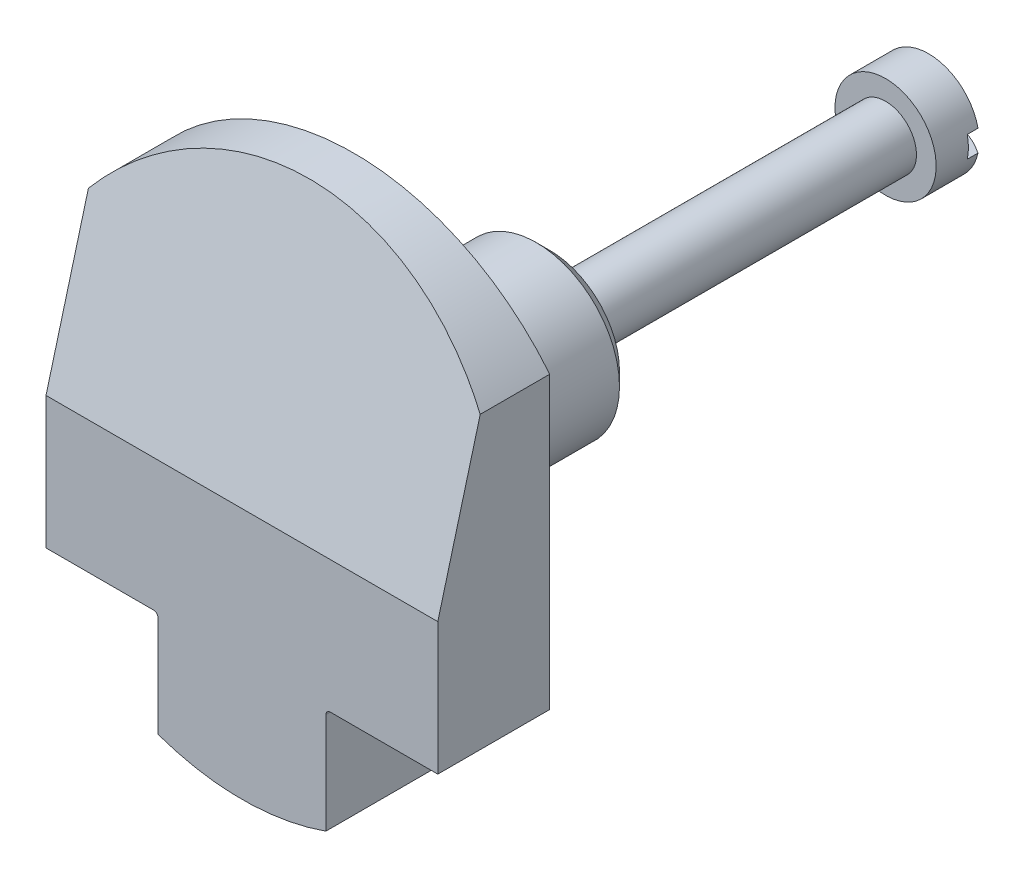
ISO-10303-21;
HEADER;
FILE_DESCRIPTION(('STEP AP214'),'2;1');
FILE_NAME('part.step','',(''),(''),'','','');
FILE_SCHEMA(('AUTOMOTIVE_DESIGN { 1 0 10303 214 1 1 1 1 }'));
ENDSEC;
DATA;
#1=APPLICATION_CONTEXT('core data for automotive mechanical design processes');
#2=APPLICATION_PROTOCOL_DEFINITION('international standard','automotive_design',2000,#1);
#3=PRODUCT_CONTEXT('',#1,'mechanical');
#4=PRODUCT('Part','Part','',(#3));
#5=PRODUCT_RELATED_PRODUCT_CATEGORY('part','',(#4));
#6=PRODUCT_DEFINITION_FORMATION('','',#4);
#7=PRODUCT_DEFINITION_CONTEXT('part definition',#1,'design');
#8=PRODUCT_DEFINITION('design','',#6,#7);
#9=PRODUCT_DEFINITION_SHAPE('','',#8);
#10=(LENGTH_UNIT() NAMED_UNIT(*) SI_UNIT(.MILLI.,.METRE.));
#11=(NAMED_UNIT(*) PLANE_ANGLE_UNIT() SI_UNIT($,.RADIAN.));
#12=(NAMED_UNIT(*) SI_UNIT($,.STERADIAN.) SOLID_ANGLE_UNIT());
#13=UNCERTAINTY_MEASURE_WITH_UNIT(LENGTH_MEASURE(1.E-05),#10,'distance_accuracy_value','');
#14=(GEOMETRIC_REPRESENTATION_CONTEXT(3) GLOBAL_UNCERTAINTY_ASSIGNED_CONTEXT((#13)) GLOBAL_UNIT_ASSIGNED_CONTEXT((#10,
#11,#12)) REPRESENTATION_CONTEXT('',''));
#15=CARTESIAN_POINT('',(0.,0.,0.));
#16=DIRECTION('',(0.,0.,1.));
#17=DIRECTION('',(1.,0.,0.));
#18=AXIS2_PLACEMENT_3D('',#15,#16,#17);
#19=CARTESIAN_POINT('',(0.,0.,-11.1125));
#20=DIRECTION('',(0.,0.,-1.));
#21=DIRECTION('',(-1.,0.,0.));
#22=AXIS2_PLACEMENT_3D('',#19,#20,#21);
#23=PLANE('',#22);
#24=CARTESIAN_POINT('',(0.,0.,-11.1125000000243));
#25=DIRECTION('',(0.,0.,1.));
#26=DIRECTION('',(1.,0.,0.));
#27=AXIS2_PLACEMENT_3D('',#24,#25,#26);
#28=CIRCLE('',#27,3.95604999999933);
#29=CARTESIAN_POINT('',(3.95604999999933,0.,-11.1125000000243));
#30=VERTEX_POINT('',#29);
#31=EDGE_CURVE('E263',#30,#30,#28,.T.);
#32=ORIENTED_EDGE('',*,*,#31,.F.);
#33=EDGE_LOOP('',(#32));
#34=FACE_BOUND('',#33,.T.);
#35=CARTESIAN_POINT('',(0.,0.,-11.1125));
#36=DIRECTION('',(0.,0.,-1.));
#37=DIRECTION('',(-1.,0.,0.));
#38=AXIS2_PLACEMENT_3D('',#35,#36,#37);
#39=CIRCLE('',#38,1.7526);
#40=CARTESIAN_POINT('',(-1.7526,0.,-11.1125));
#41=VERTEX_POINT('',#40);
#42=EDGE_CURVE('E9',#41,#41,#39,.F.);
#43=ORIENTED_EDGE('',*,*,#42,.T.);
#44=EDGE_LOOP('',(#43));
#45=FACE_BOUND('',#44,.T.);
#46=ADVANCED_FACE('F14',(#34,#45),#23,.T.);
#47=CARTESIAN_POINT('',(0.,0.,-10.3504999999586));
#48=DIRECTION('',(0.,0.,1.));
#49=DIRECTION('',(1.,0.,0.));
#50=AXIS2_PLACEMENT_3D('',#47,#48,#49);
#51=CONICAL_SURFACE('',#50,4.71805000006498,0.785398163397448);
#52=CARTESIAN_POINT('',(0.,0.,-10.3505));
#53=DIRECTION('',(0.,0.,1.));
#54=DIRECTION('',(1.,0.,0.));
#55=AXIS2_PLACEMENT_3D('',#52,#53,#54);
#56=CIRCLE('',#55,4.71805);
#57=CARTESIAN_POINT('',(4.71805,0.,-10.3505));
#58=VERTEX_POINT('',#57);
#59=EDGE_CURVE('E125',#58,#58,#56,.T.);
#60=ORIENTED_EDGE('',*,*,#59,.F.);
#61=EDGE_LOOP('',(#60));
#62=FACE_BOUND('',#61,.T.);
#63=ORIENTED_EDGE('',*,*,#31,.T.);
#64=EDGE_LOOP('',(#63));
#65=FACE_BOUND('',#64,.T.);
#66=ADVANCED_FACE('F286',(#62,#65),#51,.T.);
#67=CARTESIAN_POINT('',(0.,0.,-11.1125));
#68=DIRECTION('',(0.,0.,1.));
#69=DIRECTION('',(1.,0.,0.));
#70=AXIS2_PLACEMENT_3D('',#67,#68,#69);
#71=CYLINDRICAL_SURFACE('',#70,4.71805);
#72=CARTESIAN_POINT('',(0.,0.,-0.254));
#73=DIRECTION('',(0.,0.,1.));
#74=DIRECTION('',(1.,0.,0.));
#75=AXIS2_PLACEMENT_3D('',#72,#73,#74);
#76=CIRCLE('',#75,4.71805);
#77=CARTESIAN_POINT('',(4.71805,0.,-0.254));
#78=VERTEX_POINT('',#77);
#79=EDGE_CURVE('E258',#78,#78,#76,.F.);
#80=ORIENTED_EDGE('',*,*,#79,.T.);
#81=EDGE_LOOP('',(#80));
#82=FACE_BOUND('',#81,.T.);
#83=ORIENTED_EDGE('',*,*,#59,.T.);
#84=EDGE_LOOP('',(#83));
#85=FACE_BOUND('',#84,.T.);
#86=ADVANCED_FACE('F284',(#82,#85),#71,.T.);
#87=CARTESIAN_POINT('',(5.0165,-7.747,6.35));
#88=DIRECTION('',(0.,0.,1.));
#89=DIRECTION('',(1.,0.,0.));
#90=AXIS2_PLACEMENT_3D('',#87,#88,#89);
#91=CYLINDRICAL_SURFACE('',#90,0.254);
#92=DIRECTION('',(0.,0.,1.));
#93=VECTOR('',#92,1.);
#94=CARTESIAN_POINT('',(4.7625,-7.747,6.35));
#95=LINE('',#94,#93);
#96=CARTESIAN_POINT('',(4.7625,-7.747,6.35));
#97=VERTEX_POINT('',#96);
#98=CARTESIAN_POINT('',(4.7625,-7.747,0.));
#99=VERTEX_POINT('',#98);
#100=EDGE_CURVE('E128',#97,#99,#95,.F.);
#101=ORIENTED_EDGE('',*,*,#100,.T.);
#102=CARTESIAN_POINT('',(5.0165,-7.747,0.));
#103=DIRECTION('',(0.,0.,1.));
#104=DIRECTION('',(1.,0.,0.));
#105=AXIS2_PLACEMENT_3D('',#102,#103,#104);
#106=CIRCLE('',#105,0.254);
#107=CARTESIAN_POINT('',(5.0165,-7.493,0.));
#108=VERTEX_POINT('',#107);
#109=EDGE_CURVE('E111',#108,#99,#106,.T.);
#110=ORIENTED_EDGE('',*,*,#109,.F.);
#111=DIRECTION('',(0.,0.,1.));
#112=VECTOR('',#111,1.);
#113=CARTESIAN_POINT('',(5.0165,-7.493,6.35));
#114=LINE('',#113,#112);
#115=CARTESIAN_POINT('',(5.0165,-7.493,6.35));
#116=VERTEX_POINT('',#115);
#117=EDGE_CURVE('E133',#108,#116,#114,.T.);
#118=ORIENTED_EDGE('',*,*,#117,.T.);
#119=CARTESIAN_POINT('',(5.0165,-7.747,6.35));
#120=DIRECTION('',(0.,0.,1.));
#121=DIRECTION('',(1.,0.,0.));
#122=AXIS2_PLACEMENT_3D('',#119,#120,#121);
#123=CIRCLE('',#122,0.254);
#124=EDGE_CURVE('E130',#97,#116,#123,.F.);
#125=ORIENTED_EDGE('',*,*,#124,.F.);
#126=EDGE_LOOP('',(#101,#110,#118,#125));
#127=FACE_BOUND('',#126,.T.);
#128=ADVANCED_FACE('F129',(#127),#91,.F.);
#129=CARTESIAN_POINT('',(-12.7,0.,6.35));
#130=DIRECTION('',(0.,-0.258819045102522,-0.965925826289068));
#131=DIRECTION('',(0.,0.965925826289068,-0.258819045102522));
#132=AXIS2_PLACEMENT_3D('',#129,#130,#131);
#133=PLANE('',#132);
#134=DIRECTION('',(0.,-0.965925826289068,0.258819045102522));
#135=VECTOR('',#134,1.);
#136=CARTESIAN_POINT('',(-11.1125,8.98025612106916,3.94374762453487));
#137=LINE('',#136,#135);
#138=CARTESIAN_POINT('',(-11.1125,8.98025612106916,3.94374762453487));
#139=VERTEX_POINT('',#138);
#140=CARTESIAN_POINT('',(-11.1125,0.,6.35));
#141=VERTEX_POINT('',#140);
#142=EDGE_CURVE('E170',#139,#141,#137,.T.);
#143=ORIENTED_EDGE('',*,*,#142,.T.);
#144=DIRECTION('',(1.,0.,0.));
#145=VECTOR('',#144,1.);
#146=CARTESIAN_POINT('',(0.,0.,6.35));
#147=LINE('',#146,#145);
#148=CARTESIAN_POINT('',(11.1125,0.,6.35));
#149=VERTEX_POINT('',#148);
#150=EDGE_CURVE('E261',#149,#141,#147,.F.);
#151=ORIENTED_EDGE('',*,*,#150,.F.);
#152=DIRECTION('',(0.,0.965925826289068,-0.258819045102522));
#153=VECTOR('',#152,1.);
#154=CARTESIAN_POINT('',(11.1125,0.,6.35));
#155=LINE('',#154,#153);
#156=CARTESIAN_POINT('',(11.1125,8.98025612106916,3.94374762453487));
#157=VERTEX_POINT('',#156);
#158=EDGE_CURVE('E256',#149,#157,#155,.T.);
#159=ORIENTED_EDGE('',*,*,#158,.T.);
#160=CARTESIAN_POINT('',(0.,0.,6.35));
#161=DIRECTION('',(0.,-0.258819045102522,-0.965925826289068));
#162=DIRECTION('',(0.,0.965925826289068,-0.258819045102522));
#163=AXIS2_PLACEMENT_3D('',#160,#161,#162);
#164=ELLIPSE('',#163,14.7915084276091,14.2875);
#165=EDGE_CURVE('E208',#139,#157,#164,.T.);
#166=ORIENTED_EDGE('',*,*,#165,.F.);
#167=EDGE_LOOP('',(#143,#151,#159,#166));
#168=FACE_BOUND('',#167,.T.);
#169=ADVANCED_FACE('F450',(#168),#133,.F.);
#170=CARTESIAN_POINT('',(-5.0165,-7.747,6.35));
#171=DIRECTION('',(0.,0.,1.));
#172=DIRECTION('',(1.,0.,0.));
#173=AXIS2_PLACEMENT_3D('',#170,#171,#172);
#174=CYLINDRICAL_SURFACE('',#173,0.254);
#175=DIRECTION('',(0.,0.,1.));
#176=VECTOR('',#175,1.);
#177=CARTESIAN_POINT('',(-5.0165,-7.493,6.35));
#178=LINE('',#177,#176);
#179=CARTESIAN_POINT('',(-5.0165,-7.493,6.35));
#180=VERTEX_POINT('',#179);
#181=CARTESIAN_POINT('',(-5.0165,-7.493,0.));
#182=VERTEX_POINT('',#181);
#183=EDGE_CURVE('E157',#180,#182,#178,.F.);
#184=ORIENTED_EDGE('',*,*,#183,.T.);
#185=CARTESIAN_POINT('',(-5.0165,-7.747,0.));
#186=DIRECTION('',(0.,0.,1.));
#187=DIRECTION('',(1.,0.,0.));
#188=AXIS2_PLACEMENT_3D('',#185,#186,#187);
#189=CIRCLE('',#188,0.254);
#190=CARTESIAN_POINT('',(-4.7625,-7.747,0.));
#191=VERTEX_POINT('',#190);
#192=EDGE_CURVE('E124',#191,#182,#189,.T.);
#193=ORIENTED_EDGE('',*,*,#192,.F.);
#194=DIRECTION('',(0.,0.,1.));
#195=VECTOR('',#194,1.);
#196=CARTESIAN_POINT('',(-4.7625,-7.747,6.35));
#197=LINE('',#196,#195);
#198=CARTESIAN_POINT('',(-4.7625,-7.747,6.35));
#199=VERTEX_POINT('',#198);
#200=EDGE_CURVE('E154',#191,#199,#197,.T.);
#201=ORIENTED_EDGE('',*,*,#200,.T.);
#202=CARTESIAN_POINT('',(-5.0165,-7.747,6.35));
#203=DIRECTION('',(0.,0.,1.));
#204=DIRECTION('',(1.,0.,0.));
#205=AXIS2_PLACEMENT_3D('',#202,#203,#204);
#206=CIRCLE('',#205,0.254);
#207=EDGE_CURVE('E259',#180,#199,#206,.F.);
#208=ORIENTED_EDGE('',*,*,#207,.F.);
#209=EDGE_LOOP('',(#184,#193,#201,#208));
#210=FACE_BOUND('',#209,.T.);
#211=ADVANCED_FACE('F446',(#210),#174,.F.);
#212=CARTESIAN_POINT('',(0.,0.,6.35));
#213=DIRECTION('',(0.,0.,1.));
#214=DIRECTION('',(1.,0.,0.));
#215=AXIS2_PLACEMENT_3D('',#212,#213,#214);
#216=PLANE('',#215);
#217=DIRECTION('',(1.,0.,0.));
#218=VECTOR('',#217,1.);
#219=CARTESIAN_POINT('',(11.1125,-7.493,6.35));
#220=LINE('',#219,#218);
#221=CARTESIAN_POINT('',(11.1125,-7.493,6.35));
#222=VERTEX_POINT('',#221);
#223=EDGE_CURVE('E176',#116,#222,#220,.T.);
#224=ORIENTED_EDGE('',*,*,#223,.T.);
#225=DIRECTION('',(0.,-1.,0.));
#226=VECTOR('',#225,1.);
#227=CARTESIAN_POINT('',(11.1125,-7.493,6.35));
#228=LINE('',#227,#226);
#229=EDGE_CURVE('E175',#222,#149,#228,.F.);
#230=ORIENTED_EDGE('',*,*,#229,.T.);
#231=ORIENTED_EDGE('',*,*,#150,.T.);
#232=DIRECTION('',(0.,1.,0.));
#233=VECTOR('',#232,1.);
#234=CARTESIAN_POINT('',(-11.1125,-7.493,6.35));
#235=LINE('',#234,#233);
#236=CARTESIAN_POINT('',(-11.1125,-7.493,6.35));
#237=VERTEX_POINT('',#236);
#238=EDGE_CURVE('E164',#141,#237,#235,.F.);
#239=ORIENTED_EDGE('',*,*,#238,.T.);
#240=DIRECTION('',(1.,0.,0.));
#241=VECTOR('',#240,1.);
#242=CARTESIAN_POINT('',(-4.7625,-7.493,6.35));
#243=LINE('',#242,#241);
#244=EDGE_CURVE('E160',#237,#180,#243,.T.);
#245=ORIENTED_EDGE('',*,*,#244,.T.);
#246=ORIENTED_EDGE('',*,*,#207,.T.);
#247=DIRECTION('',(0.,1.,0.));
#248=VECTOR('',#247,1.);
#249=CARTESIAN_POINT('',(-4.7625,-7.493,6.35));
#250=LINE('',#249,#248);
#251=CARTESIAN_POINT('',(-4.7625,-13.4703841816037,6.35));
#252=VERTEX_POINT('',#251);
#253=EDGE_CURVE('E153',#199,#252,#250,.F.);
#254=ORIENTED_EDGE('',*,*,#253,.T.);
#255=CARTESIAN_POINT('',(0.,0.,6.35));
#256=DIRECTION('',(0.,0.,-1.));
#257=DIRECTION('',(-1.,0.,0.));
#258=AXIS2_PLACEMENT_3D('',#255,#256,#257);
#259=CIRCLE('',#258,14.2875);
#260=CARTESIAN_POINT('',(4.7625,-13.4703841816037,6.35));
#261=VERTEX_POINT('',#260);
#262=EDGE_CURVE('E151',#261,#252,#259,.T.);
#263=ORIENTED_EDGE('',*,*,#262,.F.);
#264=DIRECTION('',(0.,-1.,0.));
#265=VECTOR('',#264,1.);
#266=CARTESIAN_POINT('',(4.7625,-7.493,6.35));
#267=LINE('',#266,#265);
#268=EDGE_CURVE('E134',#261,#97,#267,.F.);
#269=ORIENTED_EDGE('',*,*,#268,.T.);
#270=ORIENTED_EDGE('',*,*,#124,.T.);
#271=EDGE_LOOP('',(#224,#230,#231,#239,#245,#246,#254,#263,#269,#270));
#272=FACE_BOUND('',#271,.T.);
#273=ADVANCED_FACE('F199',(#272),#216,.T.);
#274=CARTESIAN_POINT('',(0.,0.,-0.254));
#275=DIRECTION('',(0.,0.,1.));
#276=DIRECTION('',(1.,0.,0.));
#277=AXIS2_PLACEMENT_3D('',#274,#275,#276);
#278=TOROIDAL_SURFACE('',#277,4.97205,0.254);
#279=CARTESIAN_POINT('',(0.,0.,0.));
#280=DIRECTION('',(0.,0.,-1.));
#281=DIRECTION('',(-1.,0.,0.));
#282=AXIS2_PLACEMENT_3D('',#279,#280,#281);
#283=CIRCLE('',#282,4.97205);
#284=CARTESIAN_POINT('',(-4.97205,0.,0.));
#285=VERTEX_POINT('',#284);
#286=CARTESIAN_POINT('',(4.97205,0.,0.));
#287=VERTEX_POINT('',#286);
#288=EDGE_CURVE('E140',#285,#287,#283,.T.);
#289=ORIENTED_EDGE('',*,*,#288,.T.);
#290=CARTESIAN_POINT('',(0.,0.,0.));
#291=DIRECTION('',(0.,0.,-1.));
#292=DIRECTION('',(1.,0.,0.));
#293=AXIS2_PLACEMENT_3D('',#290,#291,#292);
#294=CIRCLE('',#293,4.97205);
#295=EDGE_CURVE('E145',#287,#285,#294,.T.);
#296=ORIENTED_EDGE('',*,*,#295,.T.);
#297=EDGE_LOOP('',(#289,#296));
#298=FACE_BOUND('',#297,.T.);
#299=ORIENTED_EDGE('',*,*,#79,.F.);
#300=EDGE_LOOP('',(#299));
#301=FACE_BOUND('',#300,.T.);
#302=ADVANCED_FACE('F188',(#298,#301),#278,.F.);
#303=CARTESIAN_POINT('',(4.7625,-7.493,6.35));
#304=DIRECTION('',(-1.,0.,0.));
#305=DIRECTION('',(0.,-1.,0.));
#306=AXIS2_PLACEMENT_3D('',#303,#304,#305);
#307=PLANE('',#306);
#308=ORIENTED_EDGE('',*,*,#100,.F.);
#309=ORIENTED_EDGE('',*,*,#268,.F.);
#310=DIRECTION('',(0.,0.,-1.));
#311=VECTOR('',#310,1.);
#312=CARTESIAN_POINT('',(4.7625,-13.4703841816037,6.35));
#313=LINE('',#312,#311);
#314=CARTESIAN_POINT('',(4.7625,-13.4703841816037,0.));
#315=VERTEX_POINT('',#314);
#316=EDGE_CURVE('E138',#315,#261,#313,.F.);
#317=ORIENTED_EDGE('',*,*,#316,.F.);
#318=DIRECTION('',(0.,1.,0.));
#319=VECTOR('',#318,1.);
#320=CARTESIAN_POINT('',(4.7625,0.,0.));
#321=LINE('',#320,#319);
#322=EDGE_CURVE('E119',#315,#99,#321,.T.);
#323=ORIENTED_EDGE('',*,*,#322,.T.);
#324=EDGE_LOOP('',(#308,#309,#317,#323));
#325=FACE_BOUND('',#324,.T.);
#326=ADVANCED_FACE('F136',(#325),#307,.F.);
#327=CARTESIAN_POINT('',(11.1125,-7.493,6.35));
#328=DIRECTION('',(0.,1.,0.));
#329=DIRECTION('',(0.,0.,1.));
#330=AXIS2_PLACEMENT_3D('',#327,#328,#329);
#331=PLANE('',#330);
#332=ORIENTED_EDGE('',*,*,#117,.F.);
#333=DIRECTION('',(1.,0.,0.));
#334=VECTOR('',#333,1.);
#335=CARTESIAN_POINT('',(0.,-7.493,0.));
#336=LINE('',#335,#334);
#337=CARTESIAN_POINT('',(11.1125,-7.493,0.));
#338=VERTEX_POINT('',#337);
#339=EDGE_CURVE('E123',#108,#338,#336,.T.);
#340=ORIENTED_EDGE('',*,*,#339,.T.);
#341=DIRECTION('',(0.,0.,1.));
#342=VECTOR('',#341,1.);
#343=CARTESIAN_POINT('',(11.1125,-7.493,6.35));
#344=LINE('',#343,#342);
#345=EDGE_CURVE('E172',#338,#222,#344,.T.);
#346=ORIENTED_EDGE('',*,*,#345,.T.);
#347=ORIENTED_EDGE('',*,*,#223,.F.);
#348=EDGE_LOOP('',(#332,#340,#346,#347));
#349=FACE_BOUND('',#348,.T.);
#350=ADVANCED_FACE('F404',(#349),#331,.F.);
#351=CARTESIAN_POINT('',(11.1125,-7.493,6.35));
#352=DIRECTION('',(-1.,0.,0.));
#353=DIRECTION('',(0.,-1.,0.));
#354=AXIS2_PLACEMENT_3D('',#351,#352,#353);
#355=PLANE('',#354);
#356=ORIENTED_EDGE('',*,*,#158,.F.);
#357=ORIENTED_EDGE('',*,*,#229,.F.);
#358=ORIENTED_EDGE('',*,*,#345,.F.);
#359=DIRECTION('',(0.,1.,0.));
#360=VECTOR('',#359,1.);
#361=CARTESIAN_POINT('',(11.1125,0.,0.));
#362=LINE('',#361,#360);
#363=CARTESIAN_POINT('',(11.1125,8.98025612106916,0.));
#364=VERTEX_POINT('',#363);
#365=EDGE_CURVE('E142',#338,#364,#362,.T.);
#366=ORIENTED_EDGE('',*,*,#365,.T.);
#367=DIRECTION('',(0.,0.,-1.));
#368=VECTOR('',#367,1.);
#369=CARTESIAN_POINT('',(11.1125,8.98025612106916,6.35));
#370=LINE('',#369,#368);
#371=EDGE_CURVE('E171',#157,#364,#370,.T.);
#372=ORIENTED_EDGE('',*,*,#371,.F.);
#373=EDGE_LOOP('',(#356,#357,#358,#366,#372));
#374=FACE_BOUND('',#373,.T.);
#375=ADVANCED_FACE('F402',(#374),#355,.F.);
#376=CARTESIAN_POINT('',(0.,0.,6.35));
#377=DIRECTION('',(0.,0.,-1.));
#378=DIRECTION('',(-1.,0.,0.));
#379=AXIS2_PLACEMENT_3D('',#376,#377,#378);
#380=CYLINDRICAL_SURFACE('',#379,14.2875);
#381=ORIENTED_EDGE('',*,*,#371,.T.);
#382=CARTESIAN_POINT('',(0.,0.,0.));
#383=DIRECTION('',(0.,0.,-1.));
#384=DIRECTION('',(-1.,0.,0.));
#385=AXIS2_PLACEMENT_3D('',#382,#383,#384);
#386=CIRCLE('',#385,14.2875);
#387=CARTESIAN_POINT('',(-11.1125,8.98025612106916,0.));
#388=VERTEX_POINT('',#387);
#389=EDGE_CURVE('E239',#364,#388,#386,.F.);
#390=ORIENTED_EDGE('',*,*,#389,.T.);
#391=DIRECTION('',(0.,0.,1.));
#392=VECTOR('',#391,1.);
#393=CARTESIAN_POINT('',(-11.1125,8.98025612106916,6.35));
#394=LINE('',#393,#392);
#395=EDGE_CURVE('E167',#388,#139,#394,.T.);
#396=ORIENTED_EDGE('',*,*,#395,.T.);
#397=ORIENTED_EDGE('',*,*,#165,.T.);
#398=EDGE_LOOP('',(#381,#390,#396,#397));
#399=FACE_BOUND('',#398,.T.);
#400=ADVANCED_FACE('F398',(#399),#380,.T.);
#401=CARTESIAN_POINT('',(-11.1125,-7.493,6.35));
#402=DIRECTION('',(1.,0.,0.));
#403=DIRECTION('',(0.,1.,0.));
#404=AXIS2_PLACEMENT_3D('',#401,#402,#403);
#405=PLANE('',#404);
#406=ORIENTED_EDGE('',*,*,#142,.F.);
#407=ORIENTED_EDGE('',*,*,#395,.F.);
#408=DIRECTION('',(0.,1.,0.));
#409=VECTOR('',#408,1.);
#410=CARTESIAN_POINT('',(-11.1125,0.,0.));
#411=LINE('',#410,#409);
#412=CARTESIAN_POINT('',(-11.1125,-7.493,0.));
#413=VERTEX_POINT('',#412);
#414=EDGE_CURVE('E234',#388,#413,#411,.F.);
#415=ORIENTED_EDGE('',*,*,#414,.T.);
#416=DIRECTION('',(0.,0.,1.));
#417=VECTOR('',#416,1.);
#418=CARTESIAN_POINT('',(-11.1125,-7.493,6.35));
#419=LINE('',#418,#417);
#420=EDGE_CURVE('E161',#413,#237,#419,.T.);
#421=ORIENTED_EDGE('',*,*,#420,.T.);
#422=ORIENTED_EDGE('',*,*,#238,.F.);
#423=EDGE_LOOP('',(#406,#407,#415,#421,#422));
#424=FACE_BOUND('',#423,.T.);
#425=ADVANCED_FACE('F394',(#424),#405,.F.);
#426=CARTESIAN_POINT('',(-4.7625,-7.493,6.35));
#427=DIRECTION('',(0.,1.,0.));
#428=DIRECTION('',(0.,0.,1.));
#429=AXIS2_PLACEMENT_3D('',#426,#427,#428);
#430=PLANE('',#429);
#431=ORIENTED_EDGE('',*,*,#183,.F.);
#432=ORIENTED_EDGE('',*,*,#244,.F.);
#433=ORIENTED_EDGE('',*,*,#420,.F.);
#434=DIRECTION('',(1.,0.,0.));
#435=VECTOR('',#434,1.);
#436=CARTESIAN_POINT('',(0.,-7.493,0.));
#437=LINE('',#436,#435);
#438=EDGE_CURVE('E231',#413,#182,#437,.T.);
#439=ORIENTED_EDGE('',*,*,#438,.T.);
#440=EDGE_LOOP('',(#431,#432,#433,#439));
#441=FACE_BOUND('',#440,.T.);
#442=ADVANCED_FACE('F388',(#441),#430,.F.);
#443=CARTESIAN_POINT('',(-4.7625,-7.493,6.35));
#444=DIRECTION('',(1.,0.,0.));
#445=DIRECTION('',(0.,1.,0.));
#446=AXIS2_PLACEMENT_3D('',#443,#444,#445);
#447=PLANE('',#446);
#448=ORIENTED_EDGE('',*,*,#200,.F.);
#449=DIRECTION('',(0.,1.,0.));
#450=VECTOR('',#449,1.);
#451=CARTESIAN_POINT('',(-4.7625,0.,0.));
#452=LINE('',#451,#450);
#453=CARTESIAN_POINT('',(-4.7625,-13.4703841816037,0.));
#454=VERTEX_POINT('',#453);
#455=EDGE_CURVE('E222',#191,#454,#452,.F.);
#456=ORIENTED_EDGE('',*,*,#455,.T.);
#457=DIRECTION('',(0.,0.,-1.));
#458=VECTOR('',#457,1.);
#459=CARTESIAN_POINT('',(-4.7625,-13.4703841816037,6.35));
#460=LINE('',#459,#458);
#461=EDGE_CURVE('E149',#252,#454,#460,.T.);
#462=ORIENTED_EDGE('',*,*,#461,.F.);
#463=ORIENTED_EDGE('',*,*,#253,.F.);
#464=EDGE_LOOP('',(#448,#456,#462,#463));
#465=FACE_BOUND('',#464,.T.);
#466=ADVANCED_FACE('F382',(#465),#447,.F.);
#467=CARTESIAN_POINT('',(0.,0.,6.35));
#468=DIRECTION('',(0.,0.,-1.));
#469=DIRECTION('',(-1.,0.,0.));
#470=AXIS2_PLACEMENT_3D('',#467,#468,#469);
#471=CYLINDRICAL_SURFACE('',#470,14.2875);
#472=ORIENTED_EDGE('',*,*,#262,.T.);
#473=ORIENTED_EDGE('',*,*,#461,.T.);
#474=CARTESIAN_POINT('',(0.,0.,0.));
#475=DIRECTION('',(0.,0.,-1.));
#476=DIRECTION('',(-1.,0.,0.));
#477=AXIS2_PLACEMENT_3D('',#474,#475,#476);
#478=CIRCLE('',#477,14.2875);
#479=EDGE_CURVE('E230',#454,#315,#478,.F.);
#480=ORIENTED_EDGE('',*,*,#479,.T.);
#481=ORIENTED_EDGE('',*,*,#316,.T.);
#482=EDGE_LOOP('',(#472,#473,#480,#481));
#483=FACE_BOUND('',#482,.T.);
#484=ADVANCED_FACE('F377',(#483),#471,.T.);
#485=CARTESIAN_POINT('',(0.,0.,0.));
#486=DIRECTION('',(0.,0.,1.));
#487=DIRECTION('',(1.,0.,0.));
#488=AXIS2_PLACEMENT_3D('',#485,#486,#487);
#489=PLANE('',#488);
#490=ORIENTED_EDGE('',*,*,#455,.F.);
#491=ORIENTED_EDGE('',*,*,#192,.T.);
#492=ORIENTED_EDGE('',*,*,#438,.F.);
#493=ORIENTED_EDGE('',*,*,#414,.F.);
#494=ORIENTED_EDGE('',*,*,#389,.F.);
#495=ORIENTED_EDGE('',*,*,#365,.F.);
#496=ORIENTED_EDGE('',*,*,#339,.F.);
#497=ORIENTED_EDGE('',*,*,#109,.T.);
#498=ORIENTED_EDGE('',*,*,#322,.F.);
#499=ORIENTED_EDGE('',*,*,#479,.F.);
#500=EDGE_LOOP('',(#490,#491,#492,#493,#494,#495,#496,#497,#498,#499));
#501=FACE_BOUND('',#500,.T.);
#502=ORIENTED_EDGE('',*,*,#295,.F.);
#503=ORIENTED_EDGE('',*,*,#288,.F.);
#504=EDGE_LOOP('',(#502,#503));
#505=FACE_BOUND('',#504,.T.);
#506=ADVANCED_FACE('F16',(#501,#505),#489,.F.);
#507=CARTESIAN_POINT('',(0.,0.,-28.5534805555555));
#508=DIRECTION('',(0.,0.,-1.));
#509=DIRECTION('',(0.,1.,0.));
#510=AXIS2_PLACEMENT_3D('',#507,#508,#509);
#511=SPHERICAL_SURFACE('',#510,4.96181944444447);
#512=CARTESIAN_POINT('',(0.,0.,-32.6009));
#513=DIRECTION('',(0.,0.,-1.));
#514=DIRECTION('',(-1.,0.,0.));
#515=AXIS2_PLACEMENT_3D('',#512,#513,#514);
#516=CIRCLE('',#515,2.8702);
#517=CARTESIAN_POINT('',(2.80471672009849,-0.6096,-32.6009));
#518=VERTEX_POINT('',#517);
#519=CARTESIAN_POINT('',(-2.80471672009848,-0.6096,-32.6009));
#520=VERTEX_POINT('',#519);
#521=EDGE_CURVE('E311',#518,#520,#516,.T.);
#522=ORIENTED_EDGE('',*,*,#521,.T.);
#523=CARTESIAN_POINT('',(0.,-0.6096,-28.5534805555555));
#524=DIRECTION('',(0.,1.,0.));
#525=DIRECTION('',(-1.,0.,0.));
#526=AXIS2_PLACEMENT_3D('',#523,#524,#525);
#527=CIRCLE('',#526,4.92422989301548);
#528=EDGE_CURVE('E308',#520,#518,#527,.F.);
#529=ORIENTED_EDGE('',*,*,#528,.T.);
#530=EDGE_LOOP('',(#522,#529));
#531=FACE_BOUND('',#530,.T.);
#532=ADVANCED_FACE('F295',(#531),#511,.T.);
#533=CARTESIAN_POINT('',(-2.80471672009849,0.6096,-32.6009));
#534=VERTEX_POINT('',#533);
#535=CARTESIAN_POINT('',(2.80471672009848,0.6096,-32.6009));
#536=VERTEX_POINT('',#535);
#537=EDGE_CURVE('E320',#534,#536,#516,.T.);
#538=ORIENTED_EDGE('',*,*,#537,.T.);
#539=CARTESIAN_POINT('',(0.,0.6096,-28.5534805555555));
#540=DIRECTION('',(0.,-1.,0.));
#541=DIRECTION('',(1.,0.,0.));
#542=AXIS2_PLACEMENT_3D('',#539,#540,#541);
#543=CIRCLE('',#542,4.92422989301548);
#544=EDGE_CURVE('E314',#536,#534,#543,.F.);
#545=ORIENTED_EDGE('',*,*,#544,.T.);
#546=EDGE_LOOP('',(#538,#545));
#547=FACE_BOUND('',#546,.T.);
#548=ADVANCED_FACE('F365',(#547),#511,.T.);
#549=CARTESIAN_POINT('',(-2.8702,0.6096,-31.9913));
#550=DIRECTION('',(0.,-1.,0.));
#551=DIRECTION('',(1.,0.,0.));
#552=AXIS2_PLACEMENT_3D('',#549,#550,#551);
#553=PLANE('',#552);
#554=DIRECTION('',(0.,0.,-1.));
#555=VECTOR('',#554,1.);
#556=CARTESIAN_POINT('',(-2.80471672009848,0.6096,-58.9153));
#557=LINE('',#556,#555);
#558=CARTESIAN_POINT('',(-2.80471672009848,0.6096,-31.9913));
#559=VERTEX_POINT('',#558);
#560=EDGE_CURVE('E323',#559,#534,#557,.T.);
#561=ORIENTED_EDGE('',*,*,#560,.T.);
#562=ORIENTED_EDGE('',*,*,#544,.F.);
#563=DIRECTION('',(0.,0.,-1.));
#564=VECTOR('',#563,1.);
#565=CARTESIAN_POINT('',(2.80471672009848,0.6096,-58.9153));
#566=LINE('',#565,#564);
#567=CARTESIAN_POINT('',(2.80471672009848,0.6096,-31.9913));
#568=VERTEX_POINT('',#567);
#569=EDGE_CURVE('E328',#536,#568,#566,.F.);
#570=ORIENTED_EDGE('',*,*,#569,.T.);
#571=DIRECTION('',(-1.,0.,0.));
#572=VECTOR('',#571,1.);
#573=CARTESIAN_POINT('',(-2.8702,0.6096,-31.9913));
#574=LINE('',#573,#572);
#575=EDGE_CURVE('E338',#568,#559,#574,.T.);
#576=ORIENTED_EDGE('',*,*,#575,.T.);
#577=EDGE_LOOP('',(#561,#562,#570,#576));
#578=FACE_BOUND('',#577,.T.);
#579=ADVANCED_FACE('F359',(#578),#553,.T.);
#580=CARTESIAN_POINT('',(-2.8702,-0.6096,-31.9913));
#581=DIRECTION('',(0.,0.,-1.));
#582=DIRECTION('',(-1.,0.,0.));
#583=AXIS2_PLACEMENT_3D('',#580,#581,#582);
#584=PLANE('',#583);
#585=ORIENTED_EDGE('',*,*,#575,.F.);
#586=CARTESIAN_POINT('',(0.,0.,-31.9913));
#587=DIRECTION('',(0.,0.,-1.));
#588=DIRECTION('',(-1.,0.,0.));
#589=AXIS2_PLACEMENT_3D('',#586,#587,#588);
#590=CIRCLE('',#589,2.8702);
#591=CARTESIAN_POINT('',(2.80471672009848,-0.6096,-31.9913));
#592=VERTEX_POINT('',#591);
#593=EDGE_CURVE('E324',#568,#592,#590,.T.);
#594=ORIENTED_EDGE('',*,*,#593,.T.);
#595=DIRECTION('',(1.,0.,0.));
#596=VECTOR('',#595,1.);
#597=CARTESIAN_POINT('',(2.8702,-0.6096,-31.9913));
#598=LINE('',#597,#596);
#599=CARTESIAN_POINT('',(-2.80471672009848,-0.6096,-31.9913));
#600=VERTEX_POINT('',#599);
#601=EDGE_CURVE('E32',#600,#592,#598,.T.);
#602=ORIENTED_EDGE('',*,*,#601,.F.);
#603=EDGE_CURVE('E321',#600,#559,#590,.T.);
#604=ORIENTED_EDGE('',*,*,#603,.T.);
#605=EDGE_LOOP('',(#585,#594,#602,#604));
#606=FACE_BOUND('',#605,.T.);
#607=ADVANCED_FACE('F337',(#606),#584,.T.);
#608=CARTESIAN_POINT('',(2.8702,-0.6096,-31.9913));
#609=DIRECTION('',(0.,1.,0.));
#610=DIRECTION('',(-1.,0.,0.));
#611=AXIS2_PLACEMENT_3D('',#608,#609,#610);
#612=PLANE('',#611);
#613=DIRECTION('',(0.,0.,-1.));
#614=VECTOR('',#613,1.);
#615=CARTESIAN_POINT('',(2.80471672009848,-0.6096,-58.9153));
#616=LINE('',#615,#614);
#617=EDGE_CURVE('E24',#592,#518,#616,.T.);
#618=ORIENTED_EDGE('',*,*,#617,.T.);
#619=ORIENTED_EDGE('',*,*,#528,.F.);
#620=DIRECTION('',(0.,0.,-1.));
#621=VECTOR('',#620,1.);
#622=CARTESIAN_POINT('',(-2.80471672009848,-0.6096,-58.9153));
#623=LINE('',#622,#621);
#624=EDGE_CURVE('E327',#520,#600,#623,.F.);
#625=ORIENTED_EDGE('',*,*,#624,.T.);
#626=ORIENTED_EDGE('',*,*,#601,.T.);
#627=EDGE_LOOP('',(#618,#619,#625,#626));
#628=FACE_BOUND('',#627,.T.);
#629=ADVANCED_FACE('F343',(#628),#612,.T.);
#630=CARTESIAN_POINT('',(0.,0.,-58.9153));
#631=DIRECTION('',(0.,0.,-1.));
#632=DIRECTION('',(-1.,0.,0.));
#633=AXIS2_PLACEMENT_3D('',#630,#631,#632);
#634=CYLINDRICAL_SURFACE('',#633,2.8702);
#635=CARTESIAN_POINT('',(0.,0.,-30.1625));
#636=DIRECTION('',(0.,0.,-1.));
#637=DIRECTION('',(-1.,0.,0.));
#638=AXIS2_PLACEMENT_3D('',#635,#636,#637);
#639=CIRCLE('',#638,2.8702);
#640=CARTESIAN_POINT('',(-2.8702,0.,-30.1625));
#641=VERTEX_POINT('',#640);
#642=EDGE_CURVE('E307',#641,#641,#639,.T.);
#643=ORIENTED_EDGE('',*,*,#642,.T.);
#644=EDGE_LOOP('',(#643));
#645=FACE_BOUND('',#644,.T.);
#646=ORIENTED_EDGE('',*,*,#617,.F.);
#647=ORIENTED_EDGE('',*,*,#593,.F.);
#648=ORIENTED_EDGE('',*,*,#569,.F.);
#649=ORIENTED_EDGE('',*,*,#537,.F.);
#650=ORIENTED_EDGE('',*,*,#560,.F.);
#651=ORIENTED_EDGE('',*,*,#603,.F.);
#652=ORIENTED_EDGE('',*,*,#624,.F.);
#653=ORIENTED_EDGE('',*,*,#521,.F.);
#654=EDGE_LOOP('',(#646,#647,#648,#649,#650,#651,#652,#653));
#655=FACE_BOUND('',#654,.T.);
#656=ADVANCED_FACE('F349',(#645,#655),#634,.T.);
#657=CARTESIAN_POINT('',(0.,1.7526,-30.1625));
#658=DIRECTION('',(0.,0.,-1.));
#659=DIRECTION('',(-1.,0.,0.));
#660=AXIS2_PLACEMENT_3D('',#657,#658,#659);
#661=PLANE('',#660);
#662=ORIENTED_EDGE('',*,*,#642,.F.);
#663=EDGE_LOOP('',(#662));
#664=FACE_BOUND('',#663,.T.);
#665=CARTESIAN_POINT('',(0.,0.,-30.1625));
#666=DIRECTION('',(0.,0.,-1.));
#667=DIRECTION('',(-1.,0.,0.));
#668=AXIS2_PLACEMENT_3D('',#665,#666,#667);
#669=CIRCLE('',#668,1.7526);
#670=CARTESIAN_POINT('',(-1.7526,0.,-30.1625));
#671=VERTEX_POINT('',#670);
#672=EDGE_CURVE('E305',#671,#671,#669,.T.);
#673=ORIENTED_EDGE('',*,*,#672,.T.);
#674=EDGE_LOOP('',(#673));
#675=FACE_BOUND('',#674,.T.);
#676=ADVANCED_FACE('F301',(#664,#675),#661,.F.);
#677=CARTESIAN_POINT('',(0.,0.,-58.9153));
#678=DIRECTION('',(0.,0.,-1.));
#679=DIRECTION('',(-1.,0.,0.));
#680=AXIS2_PLACEMENT_3D('',#677,#678,#679);
#681=CYLINDRICAL_SURFACE('',#680,1.7526);
#682=ORIENTED_EDGE('',*,*,#42,.F.);
#683=EDGE_LOOP('',(#682));
#684=FACE_BOUND('',#683,.T.);
#685=ORIENTED_EDGE('',*,*,#672,.F.);
#686=EDGE_LOOP('',(#685));
#687=FACE_BOUND('',#686,.T.);
#688=ADVANCED_FACE('F298',(#684,#687),#681,.T.);
#689=CLOSED_SHELL('',(#46,#66,#86,#128,#169,#211,#273,#302,#326,#350,#375,#400,#425,#442,#466,
#484,#506,#532,#548,#579,#607,#629,#656,#676,#688));
#690=MANIFOLD_SOLID_BREP('B1',#689);
#691=ADVANCED_BREP_SHAPE_REPRESENTATION('',(#18,#690),#14);
#692=SHAPE_DEFINITION_REPRESENTATION(#9,#691);
ENDSEC;
END-ISO-10303-21;
